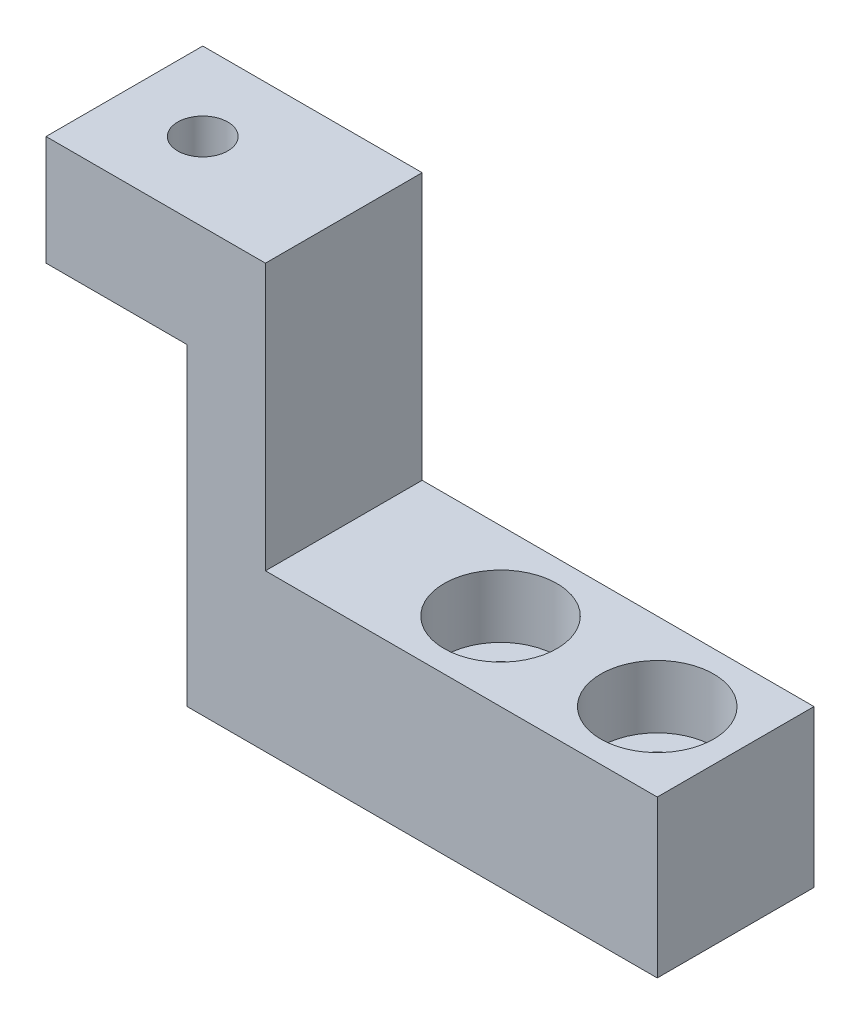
ISO-10303-21;
HEADER;
FILE_DESCRIPTION(('STEP AP214'),'2;1');
FILE_NAME('part.step','',(''),(''),'','','');
FILE_SCHEMA(('AUTOMOTIVE_DESIGN { 1 0 10303 214 1 1 1 1 }'));
ENDSEC;
DATA;
#1=APPLICATION_CONTEXT('core data for automotive mechanical design processes');
#2=APPLICATION_PROTOCOL_DEFINITION('international standard','automotive_design',2000,#1);
#3=PRODUCT_CONTEXT('',#1,'mechanical');
#4=PRODUCT('Part','Part','',(#3));
#5=PRODUCT_RELATED_PRODUCT_CATEGORY('part','',(#4));
#6=PRODUCT_DEFINITION_FORMATION('','',#4);
#7=PRODUCT_DEFINITION_CONTEXT('part definition',#1,'design');
#8=PRODUCT_DEFINITION('design','',#6,#7);
#9=PRODUCT_DEFINITION_SHAPE('','',#8);
#10=(LENGTH_UNIT() NAMED_UNIT(*) SI_UNIT(.MILLI.,.METRE.));
#11=(NAMED_UNIT(*) PLANE_ANGLE_UNIT() SI_UNIT($,.RADIAN.));
#12=(NAMED_UNIT(*) SI_UNIT($,.STERADIAN.) SOLID_ANGLE_UNIT());
#13=UNCERTAINTY_MEASURE_WITH_UNIT(LENGTH_MEASURE(1.E-05),#10,'distance_accuracy_value','');
#14=(GEOMETRIC_REPRESENTATION_CONTEXT(3) GLOBAL_UNCERTAINTY_ASSIGNED_CONTEXT((#13)) GLOBAL_UNIT_ASSIGNED_CONTEXT((#10,
#11,#12)) REPRESENTATION_CONTEXT('',''));
#15=CARTESIAN_POINT('',(0.,0.,0.));
#16=DIRECTION('',(0.,0.,1.));
#17=DIRECTION('',(1.,0.,0.));
#18=AXIS2_PLACEMENT_3D('',#15,#16,#17);
#19=CARTESIAN_POINT('',(-5.,-0.001000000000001,5.));
#20=DIRECTION('',(0.,1.,0.));
#21=DIRECTION('',(0.,0.,1.));
#22=AXIS2_PLACEMENT_3D('',#19,#20,#21);
#23=CYLINDRICAL_SURFACE('',#22,2.1);
#24=CARTESIAN_POINT('',(-5.,0.,5.));
#25=DIRECTION('',(0.,-1.,0.));
#26=DIRECTION('',(1.,0.,0.));
#27=AXIS2_PLACEMENT_3D('',#24,#25,#26);
#28=CIRCLE('',#27,2.1);
#29=CARTESIAN_POINT('',(-2.9,0.,5.));
#30=VERTEX_POINT('',#29);
#31=EDGE_CURVE('E124',#30,#30,#28,.F.);
#32=ORIENTED_EDGE('',*,*,#31,.F.);
#33=EDGE_LOOP('',(#32));
#34=FACE_BOUND('',#33,.T.);
#35=CARTESIAN_POINT('',(-5.,6.,5.));
#36=DIRECTION('',(0.,1.,0.));
#37=DIRECTION('',(0.,0.,1.));
#38=AXIS2_PLACEMENT_3D('',#35,#36,#37);
#39=CIRCLE('',#38,2.1);
#40=CARTESIAN_POINT('',(-5.,6.,7.10000000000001));
#41=VERTEX_POINT('',#40);
#42=EDGE_CURVE('E42',#41,#41,#39,.F.);
#43=ORIENTED_EDGE('',*,*,#42,.F.);
#44=EDGE_LOOP('',(#43));
#45=FACE_BOUND('',#44,.T.);
#46=ADVANCED_FACE('F38',(#34,#45),#23,.F.);
#47=CARTESIAN_POINT('',(-15.,0.,5.));
#48=DIRECTION('',(0.,1.,0.));
#49=DIRECTION('',(0.,0.,1.));
#50=AXIS2_PLACEMENT_3D('',#47,#48,#49);
#51=CYLINDRICAL_SURFACE('',#50,2.1);
#52=CARTESIAN_POINT('',(-15.,0.,5.));
#53=DIRECTION('',(0.,1.,0.));
#54=DIRECTION('',(0.,0.,1.));
#55=AXIS2_PLACEMENT_3D('',#52,#53,#54);
#56=CIRCLE('',#55,2.1);
#57=CARTESIAN_POINT('',(-15.,0.,7.10000000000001));
#58=VERTEX_POINT('',#57);
#59=EDGE_CURVE('E127',#58,#58,#56,.T.);
#60=ORIENTED_EDGE('',*,*,#59,.F.);
#61=EDGE_LOOP('',(#60));
#62=FACE_BOUND('',#61,.T.);
#63=CARTESIAN_POINT('',(-15.,6.,5.));
#64=DIRECTION('',(0.,1.,0.));
#65=DIRECTION('',(0.,0.,1.));
#66=AXIS2_PLACEMENT_3D('',#63,#64,#65);
#67=CIRCLE('',#66,2.1);
#68=CARTESIAN_POINT('',(-15.,6.,7.10000000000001));
#69=VERTEX_POINT('',#68);
#70=EDGE_CURVE('E171',#69,#69,#67,.F.);
#71=ORIENTED_EDGE('',*,*,#70,.F.);
#72=EDGE_LOOP('',(#71));
#73=FACE_BOUND('',#72,.T.);
#74=ADVANCED_FACE('F233',(#62,#73),#51,.F.);
#75=CARTESIAN_POINT('',(0.,10.,10.));
#76=DIRECTION('',(1.,0.,0.));
#77=DIRECTION('',(0.,1.,0.));
#78=AXIS2_PLACEMENT_3D('',#75,#76,#77);
#79=PLANE('',#78);
#80=DIRECTION('',(0.,-1.,0.));
#81=VECTOR('',#80,1.);
#82=CARTESIAN_POINT('',(0.,10.,0.));
#83=LINE('',#82,#81);
#84=CARTESIAN_POINT('',(0.,10.,0.));
#85=VERTEX_POINT('',#84);
#86=CARTESIAN_POINT('',(0.,0.,0.));
#87=VERTEX_POINT('',#86);
#88=EDGE_CURVE('E104',#85,#87,#83,.T.);
#89=ORIENTED_EDGE('',*,*,#88,.F.);
#90=DIRECTION('',(0.,0.,-1.));
#91=VECTOR('',#90,1.);
#92=CARTESIAN_POINT('',(0.,10.,10.));
#93=LINE('',#92,#91);
#94=CARTESIAN_POINT('',(0.,10.,10.));
#95=VERTEX_POINT('',#94);
#96=EDGE_CURVE('E11',#95,#85,#93,.T.);
#97=ORIENTED_EDGE('',*,*,#96,.F.);
#98=DIRECTION('',(0.,-1.,0.));
#99=VECTOR('',#98,1.);
#100=CARTESIAN_POINT('',(0.,10.,10.));
#101=LINE('',#100,#99);
#102=CARTESIAN_POINT('',(0.,0.,10.));
#103=VERTEX_POINT('',#102);
#104=EDGE_CURVE('E106',#95,#103,#101,.T.);
#105=ORIENTED_EDGE('',*,*,#104,.T.);
#106=DIRECTION('',(0.,0.,-1.));
#107=VECTOR('',#106,1.);
#108=CARTESIAN_POINT('',(0.,0.,10.));
#109=LINE('',#108,#107);
#110=EDGE_CURVE('E101',#103,#87,#109,.T.);
#111=ORIENTED_EDGE('',*,*,#110,.T.);
#112=EDGE_LOOP('',(#89,#97,#105,#111));
#113=FACE_BOUND('',#112,.T.);
#114=ADVANCED_FACE('F40',(#113),#79,.T.);
#115=CARTESIAN_POINT('',(-25.,9.99999999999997,10.));
#116=DIRECTION('',(0.,1.,0.));
#117=DIRECTION('',(0.,0.,1.));
#118=AXIS2_PLACEMENT_3D('',#115,#116,#117);
#119=PLANE('',#118);
#120=CARTESIAN_POINT('',(-5.,10.,5.));
#121=DIRECTION('',(0.,1.,0.));
#122=DIRECTION('',(0.,0.,1.));
#123=AXIS2_PLACEMENT_3D('',#120,#121,#122);
#124=CIRCLE('',#123,3.6);
#125=CARTESIAN_POINT('',(-5.,10.,8.60000000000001));
#126=VERTEX_POINT('',#125);
#127=EDGE_CURVE('E188',#126,#126,#124,.T.);
#128=ORIENTED_EDGE('',*,*,#127,.F.);
#129=EDGE_LOOP('',(#128));
#130=FACE_BOUND('',#129,.T.);
#131=CARTESIAN_POINT('',(-15.,9.99999999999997,5.));
#132=DIRECTION('',(0.,1.,0.));
#133=DIRECTION('',(0.,0.,1.));
#134=AXIS2_PLACEMENT_3D('',#131,#132,#133);
#135=CIRCLE('',#134,3.6);
#136=CARTESIAN_POINT('',(-15.,9.99999999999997,8.6));
#137=VERTEX_POINT('',#136);
#138=EDGE_CURVE('E178',#137,#137,#135,.T.);
#139=ORIENTED_EDGE('',*,*,#138,.F.);
#140=EDGE_LOOP('',(#139));
#141=FACE_BOUND('',#140,.T.);
#142=DIRECTION('',(1.,0.,0.));
#143=VECTOR('',#142,1.);
#144=CARTESIAN_POINT('',(-25.,10.,0.));
#145=LINE('',#144,#143);
#146=CARTESIAN_POINT('',(-25.,10.,0.));
#147=VERTEX_POINT('',#146);
#148=EDGE_CURVE('E123',#147,#85,#145,.T.);
#149=ORIENTED_EDGE('',*,*,#148,.F.);
#150=DIRECTION('',(0.,0.,-1.));
#151=VECTOR('',#150,1.);
#152=CARTESIAN_POINT('',(-25.,9.99999999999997,10.));
#153=LINE('',#152,#151);
#154=CARTESIAN_POINT('',(-25.,9.99999999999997,10.));
#155=VERTEX_POINT('',#154);
#156=EDGE_CURVE('E47',#155,#147,#153,.T.);
#157=ORIENTED_EDGE('',*,*,#156,.F.);
#158=DIRECTION('',(1.,0.,0.));
#159=VECTOR('',#158,1.);
#160=CARTESIAN_POINT('',(-25.,9.99999999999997,10.));
#161=LINE('',#160,#159);
#162=EDGE_CURVE('E111',#155,#95,#161,.T.);
#163=ORIENTED_EDGE('',*,*,#162,.T.);
#164=ORIENTED_EDGE('',*,*,#96,.T.);
#165=EDGE_LOOP('',(#149,#157,#163,#164));
#166=FACE_BOUND('',#165,.T.);
#167=ADVANCED_FACE('F223',(#130,#141,#166),#119,.T.);
#168=CARTESIAN_POINT('',(-25.,27.,10.));
#169=DIRECTION('',(1.,0.,0.));
#170=DIRECTION('',(0.,1.,0.));
#171=AXIS2_PLACEMENT_3D('',#168,#169,#170);
#172=PLANE('',#171);
#173=DIRECTION('',(0.,-1.,0.));
#174=VECTOR('',#173,1.);
#175=CARTESIAN_POINT('',(-25.,27.,0.));
#176=LINE('',#175,#174);
#177=CARTESIAN_POINT('',(-25.,27.,0.));
#178=VERTEX_POINT('',#177);
#179=EDGE_CURVE('E141',#178,#147,#176,.T.);
#180=ORIENTED_EDGE('',*,*,#179,.F.);
#181=DIRECTION('',(0.,0.,-1.));
#182=VECTOR('',#181,1.);
#183=CARTESIAN_POINT('',(-25.,27.,10.));
#184=LINE('',#183,#182);
#185=CARTESIAN_POINT('',(-25.,27.,10.));
#186=VERTEX_POINT('',#185);
#187=EDGE_CURVE('E163',#186,#178,#184,.T.);
#188=ORIENTED_EDGE('',*,*,#187,.F.);
#189=DIRECTION('',(0.,-1.,0.));
#190=VECTOR('',#189,1.);
#191=CARTESIAN_POINT('',(-25.,27.,10.));
#192=LINE('',#191,#190);
#193=EDGE_CURVE('E159',#186,#155,#192,.T.);
#194=ORIENTED_EDGE('',*,*,#193,.T.);
#195=ORIENTED_EDGE('',*,*,#156,.T.);
#196=EDGE_LOOP('',(#180,#188,#194,#195));
#197=FACE_BOUND('',#196,.T.);
#198=ADVANCED_FACE('F204',(#197),#172,.T.);
#199=CARTESIAN_POINT('',(-39.,27.,10.));
#200=DIRECTION('',(0.,1.,0.));
#201=DIRECTION('',(0.,0.,1.));
#202=AXIS2_PLACEMENT_3D('',#199,#200,#201);
#203=PLANE('',#202);
#204=CARTESIAN_POINT('',(-34.,27.,4.99999999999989));
#205=DIRECTION('',(0.,1.,0.));
#206=DIRECTION('',(0.,0.,1.));
#207=AXIS2_PLACEMENT_3D('',#204,#205,#206);
#208=CIRCLE('',#207,1.6);
#209=CARTESIAN_POINT('',(-34.,27.,6.59999999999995));
#210=VERTEX_POINT('',#209);
#211=EDGE_CURVE('E191',#210,#210,#208,.T.);
#212=ORIENTED_EDGE('',*,*,#211,.F.);
#213=EDGE_LOOP('',(#212));
#214=FACE_BOUND('',#213,.T.);
#215=DIRECTION('',(1.,0.,0.));
#216=VECTOR('',#215,1.);
#217=CARTESIAN_POINT('',(-39.,27.,0.));
#218=LINE('',#217,#216);
#219=CARTESIAN_POINT('',(-39.,27.,0.));
#220=VERTEX_POINT('',#219);
#221=EDGE_CURVE('E138',#220,#178,#218,.T.);
#222=ORIENTED_EDGE('',*,*,#221,.F.);
#223=DIRECTION('',(0.,0.,-1.));
#224=VECTOR('',#223,1.);
#225=CARTESIAN_POINT('',(-39.,27.,10.));
#226=LINE('',#225,#224);
#227=CARTESIAN_POINT('',(-39.,27.,10.));
#228=VERTEX_POINT('',#227);
#229=EDGE_CURVE('E165',#228,#220,#226,.T.);
#230=ORIENTED_EDGE('',*,*,#229,.F.);
#231=DIRECTION('',(1.,0.,0.));
#232=VECTOR('',#231,1.);
#233=CARTESIAN_POINT('',(-39.,27.,10.));
#234=LINE('',#233,#232);
#235=EDGE_CURVE('E156',#228,#186,#234,.T.);
#236=ORIENTED_EDGE('',*,*,#235,.T.);
#237=ORIENTED_EDGE('',*,*,#187,.T.);
#238=EDGE_LOOP('',(#222,#230,#236,#237));
#239=FACE_BOUND('',#238,.T.);
#240=ADVANCED_FACE('F200',(#214,#239),#203,.T.);
#241=CARTESIAN_POINT('',(-39.,20.,10.));
#242=DIRECTION('',(-1.,0.,0.));
#243=DIRECTION('',(0.,0.,1.));
#244=AXIS2_PLACEMENT_3D('',#241,#242,#243);
#245=PLANE('',#244);
#246=DIRECTION('',(0.,1.,0.));
#247=VECTOR('',#246,1.);
#248=CARTESIAN_POINT('',(-39.,20.,0.));
#249=LINE('',#248,#247);
#250=CARTESIAN_POINT('',(-39.,20.,0.));
#251=VERTEX_POINT('',#250);
#252=EDGE_CURVE('E135',#251,#220,#249,.T.);
#253=ORIENTED_EDGE('',*,*,#252,.F.);
#254=DIRECTION('',(0.,0.,-1.));
#255=VECTOR('',#254,1.);
#256=CARTESIAN_POINT('',(-39.,20.,10.));
#257=LINE('',#256,#255);
#258=CARTESIAN_POINT('',(-39.,20.,10.));
#259=VERTEX_POINT('',#258);
#260=EDGE_CURVE('E167',#259,#251,#257,.T.);
#261=ORIENTED_EDGE('',*,*,#260,.F.);
#262=DIRECTION('',(0.,1.,0.));
#263=VECTOR('',#262,1.);
#264=CARTESIAN_POINT('',(-39.,20.,10.));
#265=LINE('',#264,#263);
#266=EDGE_CURVE('E153',#259,#228,#265,.T.);
#267=ORIENTED_EDGE('',*,*,#266,.T.);
#268=ORIENTED_EDGE('',*,*,#229,.T.);
#269=EDGE_LOOP('',(#253,#261,#267,#268));
#270=FACE_BOUND('',#269,.T.);
#271=ADVANCED_FACE('F203',(#270),#245,.T.);
#272=CARTESIAN_POINT('',(-30.,20.,10.));
#273=DIRECTION('',(0.,-1.,0.));
#274=DIRECTION('',(0.,0.,-1.));
#275=AXIS2_PLACEMENT_3D('',#272,#273,#274);
#276=PLANE('',#275);
#277=CARTESIAN_POINT('',(-34.,20.,4.99999999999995));
#278=DIRECTION('',(0.,-1.,0.));
#279=DIRECTION('',(0.,0.,-1.));
#280=AXIS2_PLACEMENT_3D('',#277,#278,#279);
#281=CIRCLE('',#280,1.6);
#282=CARTESIAN_POINT('',(-34.,20.,6.59999999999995));
#283=VERTEX_POINT('',#282);
#284=EDGE_CURVE('E192',#283,#283,#281,.F.);
#285=ORIENTED_EDGE('',*,*,#284,.T.);
#286=EDGE_LOOP('',(#285));
#287=FACE_BOUND('',#286,.T.);
#288=DIRECTION('',(-1.,0.,0.));
#289=VECTOR('',#288,1.);
#290=CARTESIAN_POINT('',(-30.,20.,0.));
#291=LINE('',#290,#289);
#292=CARTESIAN_POINT('',(-30.,20.,0.));
#293=VERTEX_POINT('',#292);
#294=EDGE_CURVE('E132',#293,#251,#291,.T.);
#295=ORIENTED_EDGE('',*,*,#294,.F.);
#296=DIRECTION('',(0.,0.,-1.));
#297=VECTOR('',#296,1.);
#298=CARTESIAN_POINT('',(-30.,20.,10.));
#299=LINE('',#298,#297);
#300=CARTESIAN_POINT('',(-30.,20.,10.));
#301=VERTEX_POINT('',#300);
#302=EDGE_CURVE('E169',#301,#293,#299,.T.);
#303=ORIENTED_EDGE('',*,*,#302,.F.);
#304=DIRECTION('',(-1.,0.,0.));
#305=VECTOR('',#304,1.);
#306=CARTESIAN_POINT('',(-30.,20.,10.));
#307=LINE('',#306,#305);
#308=EDGE_CURVE('E150',#301,#259,#307,.T.);
#309=ORIENTED_EDGE('',*,*,#308,.T.);
#310=ORIENTED_EDGE('',*,*,#260,.T.);
#311=EDGE_LOOP('',(#295,#303,#309,#310));
#312=FACE_BOUND('',#311,.T.);
#313=ADVANCED_FACE('F219',(#287,#312),#276,.T.);
#314=CARTESIAN_POINT('',(-30.,0.,10.));
#315=DIRECTION('',(-1.,0.,0.));
#316=DIRECTION('',(0.,0.,1.));
#317=AXIS2_PLACEMENT_3D('',#314,#315,#316);
#318=PLANE('',#317);
#319=DIRECTION('',(0.,1.,0.));
#320=VECTOR('',#319,1.);
#321=CARTESIAN_POINT('',(-30.,0.,0.));
#322=LINE('',#321,#320);
#323=CARTESIAN_POINT('',(-30.,0.,0.));
#324=VERTEX_POINT('',#323);
#325=EDGE_CURVE('E119',#324,#293,#322,.T.);
#326=ORIENTED_EDGE('',*,*,#325,.F.);
#327=DIRECTION('',(0.,0.,-1.));
#328=VECTOR('',#327,1.);
#329=CARTESIAN_POINT('',(-30.,0.,10.));
#330=LINE('',#329,#328);
#331=CARTESIAN_POINT('',(-30.,0.,10.));
#332=VERTEX_POINT('',#331);
#333=EDGE_CURVE('E110',#332,#324,#330,.T.);
#334=ORIENTED_EDGE('',*,*,#333,.F.);
#335=DIRECTION('',(0.,1.,0.));
#336=VECTOR('',#335,1.);
#337=CARTESIAN_POINT('',(-30.,0.,10.));
#338=LINE('',#337,#336);
#339=EDGE_CURVE('E147',#332,#301,#338,.T.);
#340=ORIENTED_EDGE('',*,*,#339,.T.);
#341=ORIENTED_EDGE('',*,*,#302,.T.);
#342=EDGE_LOOP('',(#326,#334,#340,#341));
#343=FACE_BOUND('',#342,.T.);
#344=ADVANCED_FACE('F221',(#343),#318,.T.);
#345=CARTESIAN_POINT('',(0.,0.,10.));
#346=DIRECTION('',(0.,-1.,0.));
#347=DIRECTION('',(1.,0.,0.));
#348=AXIS2_PLACEMENT_3D('',#345,#346,#347);
#349=PLANE('',#348);
#350=ORIENTED_EDGE('',*,*,#59,.T.);
#351=EDGE_LOOP('',(#350));
#352=FACE_BOUND('',#351,.T.);
#353=ORIENTED_EDGE('',*,*,#31,.T.);
#354=EDGE_LOOP('',(#353));
#355=FACE_BOUND('',#354,.T.);
#356=DIRECTION('',(-1.,0.,0.));
#357=VECTOR('',#356,1.);
#358=CARTESIAN_POINT('',(0.,0.,0.));
#359=LINE('',#358,#357);
#360=EDGE_CURVE('E114',#87,#324,#359,.T.);
#361=ORIENTED_EDGE('',*,*,#360,.F.);
#362=ORIENTED_EDGE('',*,*,#110,.F.);
#363=DIRECTION('',(-1.,0.,0.));
#364=VECTOR('',#363,1.);
#365=CARTESIAN_POINT('',(0.,0.,10.));
#366=LINE('',#365,#364);
#367=EDGE_CURVE('E145',#103,#332,#366,.T.);
#368=ORIENTED_EDGE('',*,*,#367,.T.);
#369=ORIENTED_EDGE('',*,*,#333,.T.);
#370=EDGE_LOOP('',(#361,#362,#368,#369));
#371=FACE_BOUND('',#370,.T.);
#372=ADVANCED_FACE('F115',(#352,#355,#371),#349,.T.);
#373=CARTESIAN_POINT('',(0.,20.,10.));
#374=DIRECTION('',(0.,0.,-1.));
#375=DIRECTION('',(-1.,0.,0.));
#376=AXIS2_PLACEMENT_3D('',#373,#374,#375);
#377=PLANE('',#376);
#378=ORIENTED_EDGE('',*,*,#104,.F.);
#379=ORIENTED_EDGE('',*,*,#162,.F.);
#380=ORIENTED_EDGE('',*,*,#193,.F.);
#381=ORIENTED_EDGE('',*,*,#235,.F.);
#382=ORIENTED_EDGE('',*,*,#266,.F.);
#383=ORIENTED_EDGE('',*,*,#308,.F.);
#384=ORIENTED_EDGE('',*,*,#339,.F.);
#385=ORIENTED_EDGE('',*,*,#367,.F.);
#386=EDGE_LOOP('',(#378,#379,#380,#381,#382,#383,#384,#385));
#387=FACE_BOUND('',#386,.T.);
#388=ADVANCED_FACE('F215',(#387),#377,.F.);
#389=CARTESIAN_POINT('',(0.,20.0000000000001,0.));
#390=DIRECTION('',(0.,0.,-1.));
#391=DIRECTION('',(-1.,0.,0.));
#392=AXIS2_PLACEMENT_3D('',#389,#390,#391);
#393=PLANE('',#392);
#394=ORIENTED_EDGE('',*,*,#88,.T.);
#395=ORIENTED_EDGE('',*,*,#360,.T.);
#396=ORIENTED_EDGE('',*,*,#325,.T.);
#397=ORIENTED_EDGE('',*,*,#294,.T.);
#398=ORIENTED_EDGE('',*,*,#252,.T.);
#399=ORIENTED_EDGE('',*,*,#221,.T.);
#400=ORIENTED_EDGE('',*,*,#179,.T.);
#401=ORIENTED_EDGE('',*,*,#148,.T.);
#402=EDGE_LOOP('',(#394,#395,#396,#397,#398,#399,#400,#401));
#403=FACE_BOUND('',#402,.T.);
#404=ADVANCED_FACE('F121',(#403),#393,.T.);
#405=CARTESIAN_POINT('',(-15.,6.,5.));
#406=DIRECTION('',(0.,1.,0.));
#407=DIRECTION('',(0.,0.,1.));
#408=AXIS2_PLACEMENT_3D('',#405,#406,#407);
#409=PLANE('',#408);
#410=CARTESIAN_POINT('',(-15.,6.,5.));
#411=DIRECTION('',(0.,1.,0.));
#412=DIRECTION('',(0.,0.,1.));
#413=AXIS2_PLACEMENT_3D('',#410,#411,#412);
#414=CIRCLE('',#413,3.6);
#415=CARTESIAN_POINT('',(-15.,6.,8.6));
#416=VERTEX_POINT('',#415);
#417=EDGE_CURVE('E173',#416,#416,#414,.T.);
#418=ORIENTED_EDGE('',*,*,#417,.T.);
#419=EDGE_LOOP('',(#418));
#420=FACE_BOUND('',#419,.T.);
#421=ORIENTED_EDGE('',*,*,#70,.T.);
#422=EDGE_LOOP('',(#421));
#423=FACE_BOUND('',#422,.T.);
#424=ADVANCED_FACE('F250',(#420,#423),#409,.T.);
#425=CARTESIAN_POINT('',(-15.,6.,5.));
#426=DIRECTION('',(0.,1.,0.));
#427=DIRECTION('',(0.,0.,1.));
#428=AXIS2_PLACEMENT_3D('',#425,#426,#427);
#429=CYLINDRICAL_SURFACE('',#428,3.6);
#430=ORIENTED_EDGE('',*,*,#417,.F.);
#431=EDGE_LOOP('',(#430));
#432=FACE_BOUND('',#431,.T.);
#433=ORIENTED_EDGE('',*,*,#138,.T.);
#434=EDGE_LOOP('',(#433));
#435=FACE_BOUND('',#434,.T.);
#436=ADVANCED_FACE('F305',(#432,#435),#429,.F.);
#437=CARTESIAN_POINT('',(-5.,6.,5.));
#438=DIRECTION('',(0.,1.,0.));
#439=DIRECTION('',(0.,0.,1.));
#440=AXIS2_PLACEMENT_3D('',#437,#438,#439);
#441=PLANE('',#440);
#442=CARTESIAN_POINT('',(-5.,6.,5.));
#443=DIRECTION('',(0.,1.,0.));
#444=DIRECTION('',(0.,0.,1.));
#445=AXIS2_PLACEMENT_3D('',#442,#443,#444);
#446=CIRCLE('',#445,3.6);
#447=CARTESIAN_POINT('',(-5.,6.,8.60000000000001));
#448=VERTEX_POINT('',#447);
#449=EDGE_CURVE('E185',#448,#448,#446,.T.);
#450=ORIENTED_EDGE('',*,*,#449,.T.);
#451=EDGE_LOOP('',(#450));
#452=FACE_BOUND('',#451,.T.);
#453=ORIENTED_EDGE('',*,*,#42,.T.);
#454=EDGE_LOOP('',(#453));
#455=FACE_BOUND('',#454,.T.);
#456=ADVANCED_FACE('F314',(#452,#455),#441,.T.);
#457=CARTESIAN_POINT('',(-5.,6.,5.));
#458=DIRECTION('',(0.,1.,0.));
#459=DIRECTION('',(0.,0.,1.));
#460=AXIS2_PLACEMENT_3D('',#457,#458,#459);
#461=CYLINDRICAL_SURFACE('',#460,3.6);
#462=ORIENTED_EDGE('',*,*,#449,.F.);
#463=EDGE_LOOP('',(#462));
#464=FACE_BOUND('',#463,.T.);
#465=ORIENTED_EDGE('',*,*,#127,.T.);
#466=EDGE_LOOP('',(#465));
#467=FACE_BOUND('',#466,.T.);
#468=ADVANCED_FACE('F324',(#464,#467),#461,.F.);
#469=CARTESIAN_POINT('',(-34.,-0.000999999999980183,4.99999999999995));
#470=DIRECTION('',(0.,1.,0.));
#471=DIRECTION('',(0.,0.,1.));
#472=AXIS2_PLACEMENT_3D('',#469,#470,#471);
#473=CYLINDRICAL_SURFACE('',#472,1.6);
#474=CARTESIAN_POINT('',(-34.,20.,6.59999999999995));
#475=CARTESIAN_POINT('',(-34.,20.0729166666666,6.59999999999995));
#476=CARTESIAN_POINT('',(-34.,20.1458333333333,6.59999999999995));
#477=CARTESIAN_POINT('',(-34.,20.2916666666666,6.59999999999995));
#478=CARTESIAN_POINT('',(-34.,20.3645833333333,6.59999999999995));
#479=CARTESIAN_POINT('',(-34.,20.5104166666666,6.59999999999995));
#480=CARTESIAN_POINT('',(-34.,20.5833333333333,6.59999999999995));
#481=CARTESIAN_POINT('',(-34.,20.7291666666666,6.59999999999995));
#482=CARTESIAN_POINT('',(-34.,20.8020833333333,6.59999999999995));
#483=CARTESIAN_POINT('',(-34.,20.9479166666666,6.59999999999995));
#484=CARTESIAN_POINT('',(-34.,21.0208333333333,6.59999999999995));
#485=CARTESIAN_POINT('',(-34.,21.1666666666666,6.59999999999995));
#486=CARTESIAN_POINT('',(-34.,21.2395833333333,6.59999999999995));
#487=CARTESIAN_POINT('',(-34.,21.3854166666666,6.59999999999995));
#488=CARTESIAN_POINT('',(-34.,21.4583333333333,6.59999999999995));
#489=CARTESIAN_POINT('',(-34.,21.6041666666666,6.59999999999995));
#490=CARTESIAN_POINT('',(-34.,21.6770833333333,6.59999999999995));
#491=CARTESIAN_POINT('',(-34.,21.8229166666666,6.59999999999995));
#492=CARTESIAN_POINT('',(-34.,21.8958333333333,6.59999999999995));
#493=CARTESIAN_POINT('',(-34.,22.0416666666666,6.59999999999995));
#494=CARTESIAN_POINT('',(-34.,22.1145833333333,6.59999999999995));
#495=CARTESIAN_POINT('',(-34.,22.2604166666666,6.59999999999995));
#496=CARTESIAN_POINT('',(-34.,22.3333333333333,6.59999999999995));
#497=CARTESIAN_POINT('',(-34.,22.4791666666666,6.59999999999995));
#498=CARTESIAN_POINT('',(-34.,22.5520833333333,6.59999999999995));
#499=CARTESIAN_POINT('',(-34.,22.6979166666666,6.59999999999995));
#500=CARTESIAN_POINT('',(-34.,22.7708333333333,6.59999999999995));
#501=CARTESIAN_POINT('',(-34.,22.9166666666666,6.59999999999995));
#502=CARTESIAN_POINT('',(-34.,22.9895833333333,6.59999999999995));
#503=CARTESIAN_POINT('',(-34.,23.1354166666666,6.59999999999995));
#504=CARTESIAN_POINT('',(-34.,23.2083333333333,6.59999999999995));
#505=CARTESIAN_POINT('',(-34.,23.3541666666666,6.59999999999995));
#506=CARTESIAN_POINT('',(-34.,23.4270833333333,6.59999999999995));
#507=CARTESIAN_POINT('',(-34.,23.5729166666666,6.59999999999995));
#508=CARTESIAN_POINT('',(-34.,23.6458333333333,6.59999999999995));
#509=CARTESIAN_POINT('',(-34.,23.7916666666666,6.59999999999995));
#510=CARTESIAN_POINT('',(-34.,23.8645833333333,6.59999999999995));
#511=CARTESIAN_POINT('',(-34.,24.0104166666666,6.59999999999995));
#512=CARTESIAN_POINT('',(-34.,24.0833333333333,6.59999999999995));
#513=CARTESIAN_POINT('',(-34.,24.2291666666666,6.59999999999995));
#514=CARTESIAN_POINT('',(-34.,24.3020833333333,6.59999999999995));
#515=CARTESIAN_POINT('',(-34.,24.4479166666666,6.59999999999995));
#516=CARTESIAN_POINT('',(-34.,24.5208333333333,6.59999999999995));
#517=CARTESIAN_POINT('',(-34.,24.6666666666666,6.59999999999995));
#518=CARTESIAN_POINT('',(-34.,24.7395833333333,6.59999999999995));
#519=CARTESIAN_POINT('',(-34.,24.8854166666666,6.59999999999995));
#520=CARTESIAN_POINT('',(-34.,24.9583333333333,6.59999999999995));
#521=CARTESIAN_POINT('',(-34.,25.1041666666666,6.59999999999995));
#522=CARTESIAN_POINT('',(-34.,25.1770833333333,6.59999999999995));
#523=CARTESIAN_POINT('',(-34.,25.3229166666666,6.59999999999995));
#524=CARTESIAN_POINT('',(-34.,25.3958333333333,6.59999999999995));
#525=CARTESIAN_POINT('',(-34.,25.5416666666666,6.59999999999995));
#526=CARTESIAN_POINT('',(-34.,25.6145833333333,6.59999999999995));
#527=CARTESIAN_POINT('',(-34.,25.7604166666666,6.59999999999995));
#528=CARTESIAN_POINT('',(-34.,25.8333333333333,6.59999999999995));
#529=CARTESIAN_POINT('',(-34.,25.9791666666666,6.59999999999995));
#530=CARTESIAN_POINT('',(-34.,26.0520833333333,6.59999999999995));
#531=CARTESIAN_POINT('',(-34.,26.1979166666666,6.59999999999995));
#532=CARTESIAN_POINT('',(-34.,26.2708333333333,6.59999999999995));
#533=CARTESIAN_POINT('',(-34.,26.4166666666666,6.59999999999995));
#534=CARTESIAN_POINT('',(-34.,26.4895833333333,6.59999999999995));
#535=CARTESIAN_POINT('',(-34.,26.6354166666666,6.59999999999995));
#536=CARTESIAN_POINT('',(-34.,26.7083333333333,6.59999999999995));
#537=CARTESIAN_POINT('',(-34.,26.8541666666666,6.59999999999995));
#538=CARTESIAN_POINT('',(-34.,26.9270833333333,6.59999999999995));
#539=CARTESIAN_POINT('',(-34.,27.,6.59999999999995));
#540=B_SPLINE_CURVE_WITH_KNOTS('',3,(#474,#475,#476,#477,#478,#479,#480,#481,#482,#483,#484,
#485,#486,#487,#488,#489,#490,#491,#492,#493,#494,#495,#496,#497,#498,#499,#500,#501,#502,#503,
#504,#505,#506,#507,#508,#509,#510,#511,#512,#513,#514,#515,#516,#517,#518,#519,#520,#521,#522,
#523,#524,#525,#526,#527,#528,#529,#530,#531,#532,#533,#534,#535,#536,#537,#538,#539),
.UNSPECIFIED.,.F.,.F.,(4,2,2,2,2,2,2,2,2,2,2,2,2,2,2,2,2,2,2,2,2,2,2,2,2,2,2,2,2,2,2,2,4),(0.,
0.21875,0.4375,0.656250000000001,0.875000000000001,1.09375,1.3125,1.53125,1.75,1.96875,2.1875,
2.40625,2.625,2.84375,3.0625,3.28125,3.5,3.71875,3.9375,4.15624999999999,4.375,4.59374999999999,
4.81249999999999,5.03124999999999,5.24999999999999,5.46874999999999,5.68749999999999,
5.90624999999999,6.12499999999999,6.34375,6.56249999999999,6.78124999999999,6.99999999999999),.UNSPECIFIED.);
#541=EDGE_CURVE('BSEAM198',#283,#210,#540,.T.);
#542=ORIENTED_EDGE('',*,*,#284,.F.);
#543=ORIENTED_EDGE('',*,*,#211,.T.);
#544=ORIENTED_EDGE('',*,*,#541,.T.);
#545=ORIENTED_EDGE('',*,*,#541,.F.);
#546=EDGE_LOOP('',(#542,#544,#543,#545));
#547=FACE_BOUND('',#546,.T.);
#548=ADVANCED_FACE('F198',(#547),#473,.F.);
#549=CLOSED_SHELL('',(#46,#74,#114,#167,#198,#240,#271,#313,#344,#372,#388,#404,#424,#436,#456,
#468,#548));
#550=MANIFOLD_SOLID_BREP('B2',#549);
#551=ADVANCED_BREP_SHAPE_REPRESENTATION('',(#18,#550),#14);
#552=SHAPE_DEFINITION_REPRESENTATION(#9,#551);
ENDSEC;
END-ISO-10303-21;
